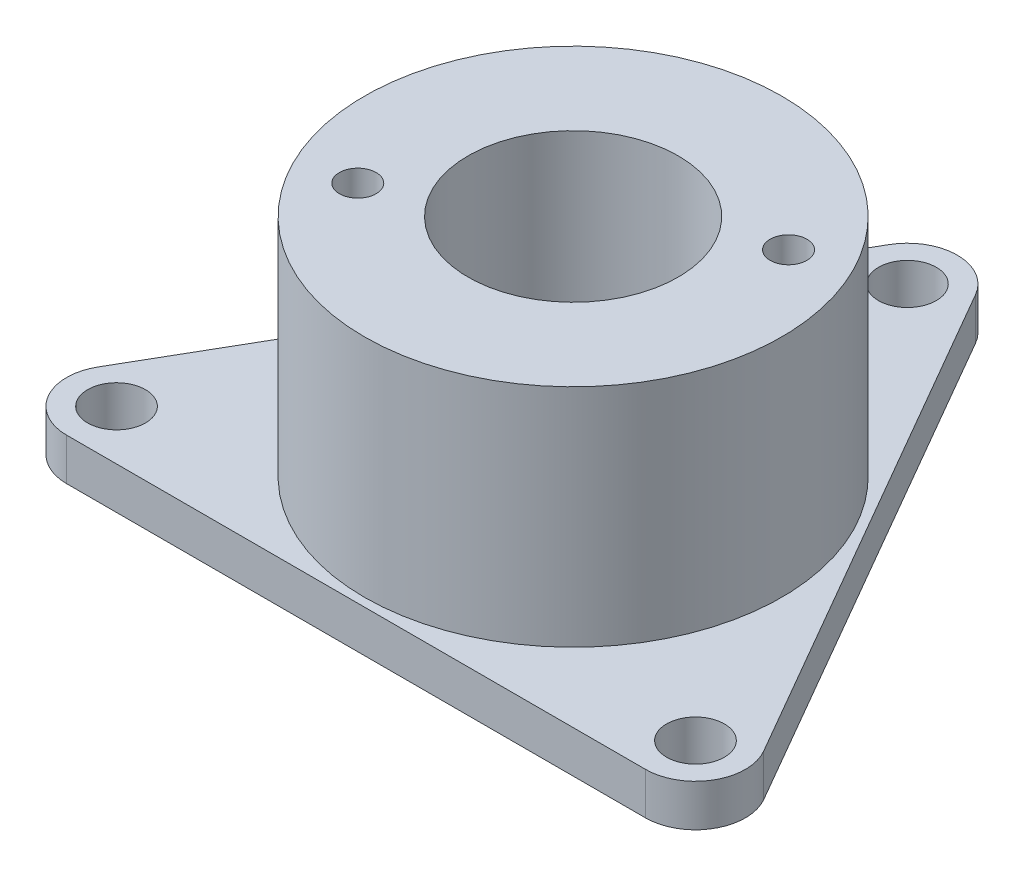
ISO-10303-21;
HEADER;
FILE_DESCRIPTION(('STEP AP214'),'2;1');
FILE_NAME('part.step','',(''),(''),'','','');
FILE_SCHEMA(('AUTOMOTIVE_DESIGN { 1 0 10303 214 1 1 1 1 }'));
ENDSEC;
DATA;
#1=APPLICATION_CONTEXT('core data for automotive mechanical design processes');
#2=APPLICATION_PROTOCOL_DEFINITION('international standard','automotive_design',2000,#1);
#3=PRODUCT_CONTEXT('',#1,'mechanical');
#4=PRODUCT('Part','Part','',(#3));
#5=PRODUCT_RELATED_PRODUCT_CATEGORY('part','',(#4));
#6=PRODUCT_DEFINITION_FORMATION('','',#4);
#7=PRODUCT_DEFINITION_CONTEXT('part definition',#1,'design');
#8=PRODUCT_DEFINITION('design','',#6,#7);
#9=PRODUCT_DEFINITION_SHAPE('','',#8);
#10=(LENGTH_UNIT() NAMED_UNIT(*) SI_UNIT(.MILLI.,.METRE.));
#11=(NAMED_UNIT(*) PLANE_ANGLE_UNIT() SI_UNIT($,.RADIAN.));
#12=(NAMED_UNIT(*) SI_UNIT($,.STERADIAN.) SOLID_ANGLE_UNIT());
#13=UNCERTAINTY_MEASURE_WITH_UNIT(LENGTH_MEASURE(1.E-05),#10,'distance_accuracy_value','');
#14=(GEOMETRIC_REPRESENTATION_CONTEXT(3) GLOBAL_UNCERTAINTY_ASSIGNED_CONTEXT((#13)) GLOBAL_UNIT_ASSIGNED_CONTEXT((#10,
#11,#12)) REPRESENTATION_CONTEXT('',''));
#15=CARTESIAN_POINT('',(0.,0.,0.));
#16=DIRECTION('',(0.,0.,1.));
#17=DIRECTION('',(1.,0.,0.));
#18=AXIS2_PLACEMENT_3D('',#15,#16,#17);
#19=CARTESIAN_POINT('',(0.,3.999992,-31.8008));
#20=DIRECTION('',(0.,1.,0.));
#21=DIRECTION('',(0.,0.,1.));
#22=AXIS2_PLACEMENT_3D('',#19,#20,#21);
#23=PLANE('',#22);
#24=CARTESIAN_POINT('',(0.,3.999992,0.));
#25=DIRECTION('',(0.,1.,0.));
#26=DIRECTION('',(0.,0.,1.));
#27=AXIS2_PLACEMENT_3D('',#24,#25,#26);
#28=CIRCLE('',#27,19.8475);
#29=CARTESIAN_POINT('',(0.,3.999992,-19.8475));
#30=VERTEX_POINT('',#29);
#31=EDGE_CURVE('E147',#30,#30,#28,.T.);
#32=ORIENTED_EDGE('',*,*,#31,.F.);
#33=EDGE_LOOP('',(#32));
#34=FACE_BOUND('',#33,.T.);
#35=CARTESIAN_POINT('',(27.5403006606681,3.999992,15.9004000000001));
#36=DIRECTION('',(0.,1.,0.));
#37=DIRECTION('',(0.,0.,1.));
#38=AXIS2_PLACEMENT_3D('',#35,#36,#37);
#39=CIRCLE('',#38,2.75);
#40=CARTESIAN_POINT('',(27.5403006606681,3.999992,18.6504000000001));
#41=VERTEX_POINT('',#40);
#42=EDGE_CURVE('E166',#41,#41,#39,.T.);
#43=ORIENTED_EDGE('',*,*,#42,.F.);
#44=EDGE_LOOP('',(#43));
#45=FACE_BOUND('',#44,.T.);
#46=CARTESIAN_POINT('',(0.,3.999992,-31.8008));
#47=DIRECTION('',(0.,1.,0.));
#48=DIRECTION('',(0.,0.,1.));
#49=AXIS2_PLACEMENT_3D('',#46,#47,#48);
#50=CIRCLE('',#49,4.75);
#51=CARTESIAN_POINT('',(4.11362066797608,3.999992,-34.1758));
#52=VERTEX_POINT('',#51);
#53=CARTESIAN_POINT('',(-4.11362066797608,3.999992,-34.1758));
#54=VERTEX_POINT('',#53);
#55=EDGE_CURVE('E139',#52,#54,#50,.T.);
#56=ORIENTED_EDGE('',*,*,#55,.T.);
#57=DIRECTION('',(-0.500000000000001,0.,0.866025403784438));
#58=VECTOR('',#57,1.);
#59=CARTESIAN_POINT('',(-4.11362066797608,3.999992,-34.1758));
#60=LINE('',#59,#58);
#61=CARTESIAN_POINT('',(-31.6539213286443,3.999992,13.5253999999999));
#62=VERTEX_POINT('',#61);
#63=EDGE_CURVE('E97',#54,#62,#60,.T.);
#64=ORIENTED_EDGE('',*,*,#63,.T.);
#65=CARTESIAN_POINT('',(-27.5403006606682,3.999992,15.9003999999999));
#66=DIRECTION('',(0.,1.,0.));
#67=DIRECTION('',(0.,0.,1.));
#68=AXIS2_PLACEMENT_3D('',#65,#66,#67);
#69=CIRCLE('',#68,4.75000000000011);
#70=CARTESIAN_POINT('',(-27.5403006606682,3.999992,20.6504));
#71=VERTEX_POINT('',#70);
#72=EDGE_CURVE('E110',#62,#71,#69,.T.);
#73=ORIENTED_EDGE('',*,*,#72,.T.);
#74=DIRECTION('',(1.,0.,0.));
#75=VECTOR('',#74,1.);
#76=CARTESIAN_POINT('',(-27.5403006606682,3.999992,20.6504000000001));
#77=LINE('',#76,#75);
#78=CARTESIAN_POINT('',(27.5403006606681,3.999992,20.6504000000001));
#79=VERTEX_POINT('',#78);
#80=EDGE_CURVE('E104',#71,#79,#77,.T.);
#81=ORIENTED_EDGE('',*,*,#80,.T.);
#82=CARTESIAN_POINT('',(27.5403006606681,3.999992,15.9004000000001));
#83=DIRECTION('',(0.,1.,0.));
#84=DIRECTION('',(0.,0.,1.));
#85=AXIS2_PLACEMENT_3D('',#82,#83,#84);
#86=CIRCLE('',#85,4.75);
#87=CARTESIAN_POINT('',(31.6539213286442,3.999992,13.5254000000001));
#88=VERTEX_POINT('',#87);
#89=EDGE_CURVE('E108',#79,#88,#86,.T.);
#90=ORIENTED_EDGE('',*,*,#89,.T.);
#91=DIRECTION('',(-0.499999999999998,0.,-0.86602540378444));
#92=VECTOR('',#91,1.);
#93=CARTESIAN_POINT('',(31.6539213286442,3.999992,13.5254000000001));
#94=LINE('',#93,#92);
#95=EDGE_CURVE('E59',#88,#52,#94,.T.);
#96=ORIENTED_EDGE('',*,*,#95,.T.);
#97=EDGE_LOOP('',(#56,#64,#73,#81,#90,#96));
#98=FACE_BOUND('',#97,.T.);
#99=CARTESIAN_POINT('',(0.,3.999992,-31.8008));
#100=DIRECTION('',(0.,1.,0.));
#101=DIRECTION('',(0.,0.,1.));
#102=AXIS2_PLACEMENT_3D('',#99,#100,#101);
#103=CIRCLE('',#102,2.75);
#104=CARTESIAN_POINT('',(0.,3.999992,-29.0508));
#105=VERTEX_POINT('',#104);
#106=EDGE_CURVE('E172',#105,#105,#103,.T.);
#107=ORIENTED_EDGE('',*,*,#106,.F.);
#108=EDGE_LOOP('',(#107));
#109=FACE_BOUND('',#108,.T.);
#110=CARTESIAN_POINT('',(-27.5403006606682,3.999992,15.9003999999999));
#111=DIRECTION('',(0.,1.,0.));
#112=DIRECTION('',(0.,0.,1.));
#113=AXIS2_PLACEMENT_3D('',#110,#111,#112);
#114=CIRCLE('',#113,2.75);
#115=CARTESIAN_POINT('',(-27.5403006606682,3.999992,18.6503999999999));
#116=VERTEX_POINT('',#115);
#117=EDGE_CURVE('E159',#116,#116,#114,.T.);
#118=ORIENTED_EDGE('',*,*,#117,.F.);
#119=EDGE_LOOP('',(#118));
#120=FACE_BOUND('',#119,.T.);
#121=ADVANCED_FACE('F41',(#34,#45,#98,#109,#120),#23,.T.);
#122=CARTESIAN_POINT('',(0.,0.,-31.8008));
#123=DIRECTION('',(0.,1.,0.));
#124=DIRECTION('',(0.,0.,1.));
#125=AXIS2_PLACEMENT_3D('',#122,#123,#124);
#126=PLANE('',#125);
#127=CARTESIAN_POINT('',(0.,0.,-31.8008));
#128=DIRECTION('',(0.,1.,0.));
#129=DIRECTION('',(0.,0.,1.));
#130=AXIS2_PLACEMENT_3D('',#127,#128,#129);
#131=CIRCLE('',#130,4.75);
#132=CARTESIAN_POINT('',(4.11362066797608,0.,-34.1758));
#133=VERTEX_POINT('',#132);
#134=CARTESIAN_POINT('',(-4.11362066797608,0.,-34.1758));
#135=VERTEX_POINT('',#134);
#136=EDGE_CURVE('E128',#133,#135,#131,.T.);
#137=ORIENTED_EDGE('',*,*,#136,.F.);
#138=DIRECTION('',(-0.499999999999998,0.,-0.86602540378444));
#139=VECTOR('',#138,1.);
#140=CARTESIAN_POINT('',(31.6539213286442,0.,13.5254000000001));
#141=LINE('',#140,#139);
#142=CARTESIAN_POINT('',(31.6539213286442,0.,13.5254000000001));
#143=VERTEX_POINT('',#142);
#144=EDGE_CURVE('E88',#143,#133,#141,.T.);
#145=ORIENTED_EDGE('',*,*,#144,.F.);
#146=CARTESIAN_POINT('',(27.5403006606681,0.,15.9004000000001));
#147=DIRECTION('',(0.,1.,0.));
#148=DIRECTION('',(0.,0.,1.));
#149=AXIS2_PLACEMENT_3D('',#146,#147,#148);
#150=CIRCLE('',#149,4.75);
#151=CARTESIAN_POINT('',(27.5403006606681,0.,20.6504000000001));
#152=VERTEX_POINT('',#151);
#153=EDGE_CURVE('E82',#152,#143,#150,.T.);
#154=ORIENTED_EDGE('',*,*,#153,.F.);
#155=DIRECTION('',(1.,0.,0.));
#156=VECTOR('',#155,1.);
#157=CARTESIAN_POINT('',(-27.5403006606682,0.,20.6504000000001));
#158=LINE('',#157,#156);
#159=CARTESIAN_POINT('',(-27.5403006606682,0.,20.6504));
#160=VERTEX_POINT('',#159);
#161=EDGE_CURVE('E118',#160,#152,#158,.T.);
#162=ORIENTED_EDGE('',*,*,#161,.F.);
#163=CARTESIAN_POINT('',(-27.5403006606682,0.,15.9003999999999));
#164=DIRECTION('',(0.,1.,0.));
#165=DIRECTION('',(0.,0.,1.));
#166=AXIS2_PLACEMENT_3D('',#163,#164,#165);
#167=CIRCLE('',#166,4.75000000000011);
#168=CARTESIAN_POINT('',(-31.6539213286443,0.,13.5253999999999));
#169=VERTEX_POINT('',#168);
#170=EDGE_CURVE('E134',#169,#160,#167,.T.);
#171=ORIENTED_EDGE('',*,*,#170,.F.);
#172=DIRECTION('',(-0.500000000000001,0.,0.866025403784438));
#173=VECTOR('',#172,1.);
#174=CARTESIAN_POINT('',(-4.11362066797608,0.,-34.1758));
#175=LINE('',#174,#173);
#176=EDGE_CURVE('E131',#135,#169,#175,.T.);
#177=ORIENTED_EDGE('',*,*,#176,.F.);
#178=EDGE_LOOP('',(#137,#145,#154,#162,#171,#177));
#179=FACE_BOUND('',#178,.T.);
#180=CARTESIAN_POINT('',(0.,0.,0.));
#181=DIRECTION('',(0.,1.,0.));
#182=DIRECTION('',(0.,0.,1.));
#183=AXIS2_PLACEMENT_3D('',#180,#181,#182);
#184=CIRCLE('',#183,15.75);
#185=CARTESIAN_POINT('',(0.,0.,15.75));
#186=VERTEX_POINT('',#185);
#187=EDGE_CURVE('E132',#186,#186,#184,.T.);
#188=ORIENTED_EDGE('',*,*,#187,.T.);
#189=EDGE_LOOP('',(#188));
#190=FACE_BOUND('',#189,.T.);
#191=CARTESIAN_POINT('',(0.,0.,-31.8008));
#192=DIRECTION('',(0.,1.,0.));
#193=DIRECTION('',(0.,0.,1.));
#194=AXIS2_PLACEMENT_3D('',#191,#192,#193);
#195=CIRCLE('',#194,2.75);
#196=CARTESIAN_POINT('',(0.,0.,-29.0508));
#197=VERTEX_POINT('',#196);
#198=EDGE_CURVE('E169',#197,#197,#195,.T.);
#199=ORIENTED_EDGE('',*,*,#198,.T.);
#200=EDGE_LOOP('',(#199));
#201=FACE_BOUND('',#200,.T.);
#202=CARTESIAN_POINT('',(27.5403006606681,0.,15.9004000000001));
#203=DIRECTION('',(0.,1.,0.));
#204=DIRECTION('',(0.,0.,1.));
#205=AXIS2_PLACEMENT_3D('',#202,#203,#204);
#206=CIRCLE('',#205,2.75);
#207=CARTESIAN_POINT('',(27.5403006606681,0.,18.6504000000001));
#208=VERTEX_POINT('',#207);
#209=EDGE_CURVE('E162',#208,#208,#206,.T.);
#210=ORIENTED_EDGE('',*,*,#209,.T.);
#211=EDGE_LOOP('',(#210));
#212=FACE_BOUND('',#211,.T.);
#213=CARTESIAN_POINT('',(-27.5403006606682,0.,15.9003999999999));
#214=DIRECTION('',(0.,1.,0.));
#215=DIRECTION('',(0.,0.,1.));
#216=AXIS2_PLACEMENT_3D('',#213,#214,#215);
#217=CIRCLE('',#216,2.75);
#218=CARTESIAN_POINT('',(-27.5403006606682,0.,18.6503999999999));
#219=VERTEX_POINT('',#218);
#220=EDGE_CURVE('E163',#219,#219,#217,.T.);
#221=ORIENTED_EDGE('',*,*,#220,.T.);
#222=EDGE_LOOP('',(#221));
#223=FACE_BOUND('',#222,.T.);
#224=ADVANCED_FACE('F188',(#179,#190,#201,#212,#223),#126,.F.);
#225=CARTESIAN_POINT('',(0.,3.999992,-31.8008));
#226=DIRECTION('',(0.,-1.,0.));
#227=DIRECTION('',(0.,0.,-1.));
#228=AXIS2_PLACEMENT_3D('',#225,#226,#227);
#229=CYLINDRICAL_SURFACE('',#228,4.75);
#230=ORIENTED_EDGE('',*,*,#136,.T.);
#231=DIRECTION('',(0.,-1.,0.));
#232=VECTOR('',#231,1.);
#233=CARTESIAN_POINT('',(-4.11362066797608,3.999992,-34.1758));
#234=LINE('',#233,#232);
#235=EDGE_CURVE('E146',#54,#135,#234,.T.);
#236=ORIENTED_EDGE('',*,*,#235,.F.);
#237=ORIENTED_EDGE('',*,*,#55,.F.);
#238=DIRECTION('',(0.,-1.,0.));
#239=VECTOR('',#238,1.);
#240=CARTESIAN_POINT('',(4.11362066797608,3.999992,-34.1758));
#241=LINE('',#240,#239);
#242=EDGE_CURVE('E124',#52,#133,#241,.T.);
#243=ORIENTED_EDGE('',*,*,#242,.T.);
#244=EDGE_LOOP('',(#230,#236,#237,#243));
#245=FACE_BOUND('',#244,.T.);
#246=ADVANCED_FACE('F191',(#245),#229,.T.);
#247=CARTESIAN_POINT('',(-4.11362066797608,3.999992,-34.1758));
#248=DIRECTION('',(0.866025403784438,0.,0.500000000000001));
#249=DIRECTION('',(0.500000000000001,0.,-0.866025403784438));
#250=AXIS2_PLACEMENT_3D('',#247,#248,#249);
#251=PLANE('',#250);
#252=ORIENTED_EDGE('',*,*,#176,.T.);
#253=DIRECTION('',(0.,-1.,0.));
#254=VECTOR('',#253,1.);
#255=CARTESIAN_POINT('',(-31.6539213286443,3.999992,13.5253999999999));
#256=LINE('',#255,#254);
#257=EDGE_CURVE('E143',#62,#169,#256,.T.);
#258=ORIENTED_EDGE('',*,*,#257,.F.);
#259=ORIENTED_EDGE('',*,*,#63,.F.);
#260=ORIENTED_EDGE('',*,*,#235,.T.);
#261=EDGE_LOOP('',(#252,#258,#259,#260));
#262=FACE_BOUND('',#261,.T.);
#263=ADVANCED_FACE('F182',(#262),#251,.F.);
#264=CARTESIAN_POINT('',(-27.5403006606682,3.999992,15.9003999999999));
#265=DIRECTION('',(0.,-1.,0.));
#266=DIRECTION('',(0.,0.,-1.));
#267=AXIS2_PLACEMENT_3D('',#264,#265,#266);
#268=CYLINDRICAL_SURFACE('',#267,4.75000000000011);
#269=ORIENTED_EDGE('',*,*,#170,.T.);
#270=DIRECTION('',(0.,-1.,0.));
#271=VECTOR('',#270,1.);
#272=CARTESIAN_POINT('',(-27.5403006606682,3.999992,20.6504));
#273=LINE('',#272,#271);
#274=EDGE_CURVE('E119',#71,#160,#273,.T.);
#275=ORIENTED_EDGE('',*,*,#274,.F.);
#276=ORIENTED_EDGE('',*,*,#72,.F.);
#277=ORIENTED_EDGE('',*,*,#257,.T.);
#278=EDGE_LOOP('',(#269,#275,#276,#277));
#279=FACE_BOUND('',#278,.T.);
#280=ADVANCED_FACE('F185',(#279),#268,.T.);
#281=CARTESIAN_POINT('',(-27.5403006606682,3.999992,20.6504000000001));
#282=DIRECTION('',(0.,0.,-1.));
#283=DIRECTION('',(-1.,0.,0.));
#284=AXIS2_PLACEMENT_3D('',#281,#282,#283);
#285=PLANE('',#284);
#286=ORIENTED_EDGE('',*,*,#161,.T.);
#287=DIRECTION('',(0.,-1.,0.));
#288=VECTOR('',#287,1.);
#289=CARTESIAN_POINT('',(27.5403006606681,3.999992,20.6504000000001));
#290=LINE('',#289,#288);
#291=EDGE_CURVE('E115',#79,#152,#290,.T.);
#292=ORIENTED_EDGE('',*,*,#291,.F.);
#293=ORIENTED_EDGE('',*,*,#80,.F.);
#294=ORIENTED_EDGE('',*,*,#274,.T.);
#295=EDGE_LOOP('',(#286,#292,#293,#294));
#296=FACE_BOUND('',#295,.T.);
#297=ADVANCED_FACE('F116',(#296),#285,.F.);
#298=CARTESIAN_POINT('',(27.5403006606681,3.999992,15.9004000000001));
#299=DIRECTION('',(0.,-1.,0.));
#300=DIRECTION('',(0.,0.,-1.));
#301=AXIS2_PLACEMENT_3D('',#298,#299,#300);
#302=CYLINDRICAL_SURFACE('',#301,4.75);
#303=ORIENTED_EDGE('',*,*,#153,.T.);
#304=DIRECTION('',(0.,-1.,0.));
#305=VECTOR('',#304,1.);
#306=CARTESIAN_POINT('',(31.6539213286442,3.999992,13.5254000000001));
#307=LINE('',#306,#305);
#308=EDGE_CURVE('E120',#88,#143,#307,.T.);
#309=ORIENTED_EDGE('',*,*,#308,.F.);
#310=ORIENTED_EDGE('',*,*,#89,.F.);
#311=ORIENTED_EDGE('',*,*,#291,.T.);
#312=EDGE_LOOP('',(#303,#309,#310,#311));
#313=FACE_BOUND('',#312,.T.);
#314=ADVANCED_FACE('F122',(#313),#302,.T.);
#315=CARTESIAN_POINT('',(31.6539213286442,3.999992,13.5254000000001));
#316=DIRECTION('',(-0.86602540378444,0.,0.499999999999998));
#317=DIRECTION('',(0.499999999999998,0.,0.86602540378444));
#318=AXIS2_PLACEMENT_3D('',#315,#316,#317);
#319=PLANE('',#318);
#320=ORIENTED_EDGE('',*,*,#144,.T.);
#321=ORIENTED_EDGE('',*,*,#242,.F.);
#322=ORIENTED_EDGE('',*,*,#95,.F.);
#323=ORIENTED_EDGE('',*,*,#308,.T.);
#324=EDGE_LOOP('',(#320,#321,#322,#323));
#325=FACE_BOUND('',#324,.T.);
#326=ADVANCED_FACE('F192',(#325),#319,.F.);
#327=CARTESIAN_POINT('',(0.,3.999992,0.));
#328=DIRECTION('',(0.,-1.,0.));
#329=DIRECTION('',(0.,0.,-1.));
#330=AXIS2_PLACEMENT_3D('',#327,#328,#329);
#331=CYLINDRICAL_SURFACE('',#330,15.75);
#332=CARTESIAN_POINT('',(0.,2.291568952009,0.));
#333=DIRECTION('',(0.,1.,0.));
#334=DIRECTION('',(0.,0.,1.));
#335=AXIS2_PLACEMENT_3D('',#332,#333,#334);
#336=CIRCLE('',#335,15.75);
#337=CARTESIAN_POINT('',(0.,2.291568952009,15.75));
#338=VERTEX_POINT('',#337);
#339=EDGE_CURVE('E51',#338,#338,#336,.T.);
#340=ORIENTED_EDGE('',*,*,#339,.T.);
#341=EDGE_LOOP('',(#340));
#342=FACE_BOUND('',#341,.T.);
#343=ORIENTED_EDGE('',*,*,#187,.F.);
#344=EDGE_LOOP('',(#343));
#345=FACE_BOUND('',#344,.T.);
#346=ADVANCED_FACE('F194',(#342,#345),#331,.F.);
#347=CARTESIAN_POINT('',(0.,3.999992,-31.8008));
#348=DIRECTION('',(0.,-1.,0.));
#349=DIRECTION('',(0.,0.,-1.));
#350=AXIS2_PLACEMENT_3D('',#347,#348,#349);
#351=CYLINDRICAL_SURFACE('',#350,2.75);
#352=ORIENTED_EDGE('',*,*,#106,.T.);
#353=EDGE_LOOP('',(#352));
#354=FACE_BOUND('',#353,.T.);
#355=ORIENTED_EDGE('',*,*,#198,.F.);
#356=EDGE_LOOP('',(#355));
#357=FACE_BOUND('',#356,.T.);
#358=ADVANCED_FACE('F200',(#354,#357),#351,.F.);
#359=CARTESIAN_POINT('',(27.5403006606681,3.999992,15.9004000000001));
#360=DIRECTION('',(0.,-1.,0.));
#361=DIRECTION('',(0.,0.,-1.));
#362=AXIS2_PLACEMENT_3D('',#359,#360,#361);
#363=CYLINDRICAL_SURFACE('',#362,2.75);
#364=ORIENTED_EDGE('',*,*,#42,.T.);
#365=EDGE_LOOP('',(#364));
#366=FACE_BOUND('',#365,.T.);
#367=ORIENTED_EDGE('',*,*,#209,.F.);
#368=EDGE_LOOP('',(#367));
#369=FACE_BOUND('',#368,.T.);
#370=ADVANCED_FACE('F214',(#366,#369),#363,.F.);
#371=CARTESIAN_POINT('',(-27.5403006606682,3.999992,15.9003999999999));
#372=DIRECTION('',(0.,-1.,0.));
#373=DIRECTION('',(0.,0.,-1.));
#374=AXIS2_PLACEMENT_3D('',#371,#372,#373);
#375=CYLINDRICAL_SURFACE('',#374,2.75);
#376=ORIENTED_EDGE('',*,*,#117,.T.);
#377=EDGE_LOOP('',(#376));
#378=FACE_BOUND('',#377,.T.);
#379=ORIENTED_EDGE('',*,*,#220,.F.);
#380=EDGE_LOOP('',(#379));
#381=FACE_BOUND('',#380,.T.);
#382=ADVANCED_FACE('F218',(#378,#381),#375,.F.);
#383=CARTESIAN_POINT('',(0.,25.459992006,0.));
#384=DIRECTION('',(0.,1.,0.));
#385=DIRECTION('',(0.,0.,1.));
#386=AXIS2_PLACEMENT_3D('',#383,#384,#385);
#387=PLANE('',#386);
#388=CARTESIAN_POINT('',(-12.9903810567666,25.459992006,7.49999999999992));
#389=DIRECTION('',(0.,1.,0.));
#390=DIRECTION('',(0.,0.,1.));
#391=AXIS2_PLACEMENT_3D('',#388,#389,#390);
#392=CIRCLE('',#391,1.75);
#393=CARTESIAN_POINT('',(-12.9903810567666,25.459992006,9.24999999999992));
#394=VERTEX_POINT('',#393);
#395=EDGE_CURVE('E262',#394,#394,#392,.T.);
#396=ORIENTED_EDGE('',*,*,#395,.F.);
#397=EDGE_LOOP('',(#396));
#398=FACE_BOUND('',#397,.T.);
#399=CARTESIAN_POINT('',(12.9903810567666,25.459992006,-7.49999999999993));
#400=DIRECTION('',(0.,1.,0.));
#401=DIRECTION('',(0.,0.,1.));
#402=AXIS2_PLACEMENT_3D('',#399,#400,#401);
#403=CIRCLE('',#402,1.75);
#404=CARTESIAN_POINT('',(12.9903810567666,25.459992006,-5.74999999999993));
#405=VERTEX_POINT('',#404);
#406=EDGE_CURVE('E267',#405,#405,#403,.T.);
#407=ORIENTED_EDGE('',*,*,#406,.F.);
#408=EDGE_LOOP('',(#407));
#409=FACE_BOUND('',#408,.T.);
#410=CARTESIAN_POINT('',(0.,25.459992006,0.));
#411=DIRECTION('',(0.,1.,0.));
#412=DIRECTION('',(0.,0.,1.));
#413=AXIS2_PLACEMENT_3D('',#410,#411,#412);
#414=CIRCLE('',#413,19.8475);
#415=CARTESIAN_POINT('',(0.,25.459992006,-19.8475));
#416=VERTEX_POINT('',#415);
#417=EDGE_CURVE('E157',#416,#416,#414,.T.);
#418=ORIENTED_EDGE('',*,*,#417,.T.);
#419=EDGE_LOOP('',(#418));
#420=FACE_BOUND('',#419,.T.);
#421=CARTESIAN_POINT('',(0.,25.459992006,0.));
#422=DIRECTION('',(0.,1.,0.));
#423=DIRECTION('',(0.,0.,1.));
#424=AXIS2_PLACEMENT_3D('',#421,#422,#423);
#425=CIRCLE('',#424,10.);
#426=CARTESIAN_POINT('',(0.,25.459992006,-10.));
#427=VERTEX_POINT('',#426);
#428=EDGE_CURVE('E265',#427,#427,#425,.T.);
#429=ORIENTED_EDGE('',*,*,#428,.F.);
#430=EDGE_LOOP('',(#429));
#431=FACE_BOUND('',#430,.T.);
#432=ADVANCED_FACE('F222',(#398,#409,#420,#431),#387,.T.);
#433=CARTESIAN_POINT('',(0.,3.999992,0.));
#434=DIRECTION('',(0.,1.,0.));
#435=DIRECTION('',(0.,0.,1.));
#436=AXIS2_PLACEMENT_3D('',#433,#434,#435);
#437=PLANE('',#436);
#438=CARTESIAN_POINT('',(0.,3.999992,0.));
#439=DIRECTION('',(0.,1.,0.));
#440=DIRECTION('',(0.,0.,1.));
#441=AXIS2_PLACEMENT_3D('',#438,#439,#440);
#442=CIRCLE('',#441,10.1620000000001);
#443=CARTESIAN_POINT('',(0.,3.999992,10.1620000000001));
#444=VERTEX_POINT('',#443);
#445=EDGE_CURVE('E11',#444,#444,#442,.F.);
#446=ORIENTED_EDGE('',*,*,#445,.T.);
#447=EDGE_LOOP('',(#446));
#448=FACE_BOUND('',#447,.T.);
#449=CARTESIAN_POINT('',(0.,3.999992,0.));
#450=DIRECTION('',(0.,1.,0.));
#451=DIRECTION('',(0.,0.,1.));
#452=AXIS2_PLACEMENT_3D('',#449,#450,#451);
#453=CIRCLE('',#452,10.);
#454=CARTESIAN_POINT('',(0.,3.999992,-10.));
#455=VERTEX_POINT('',#454);
#456=EDGE_CURVE('E261',#455,#455,#453,.T.);
#457=ORIENTED_EDGE('',*,*,#456,.T.);
#458=EDGE_LOOP('',(#457));
#459=FACE_BOUND('',#458,.T.);
#460=ADVANCED_FACE('F228',(#448,#459),#437,.F.);
#461=CARTESIAN_POINT('',(0.,25.459992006,0.));
#462=DIRECTION('',(0.,-1.,0.));
#463=DIRECTION('',(0.,0.,-1.));
#464=AXIS2_PLACEMENT_3D('',#461,#462,#463);
#465=CYLINDRICAL_SURFACE('',#464,19.8475);
#466=CARTESIAN_POINT('',(0.,25.459992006,-19.8475));
#467=CARTESIAN_POINT('',(0.,25.2364503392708,-19.8475));
#468=CARTESIAN_POINT('',(0.,25.0129086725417,-19.8475));
#469=CARTESIAN_POINT('',(0.,24.5658253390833,-19.8475));
#470=CARTESIAN_POINT('',(0.,24.3422836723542,-19.8475));
#471=CARTESIAN_POINT('',(0.,23.8952003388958,-19.8475));
#472=CARTESIAN_POINT('',(0.,23.6716586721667,-19.8475));
#473=CARTESIAN_POINT('',(0.,23.2245753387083,-19.8475));
#474=CARTESIAN_POINT('',(0.,23.0010336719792,-19.8475));
#475=CARTESIAN_POINT('',(0.,22.5539503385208,-19.8475));
#476=CARTESIAN_POINT('',(0.,22.3304086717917,-19.8475));
#477=CARTESIAN_POINT('',(0.,21.8833253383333,-19.8475));
#478=CARTESIAN_POINT('',(0.,21.6597836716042,-19.8475));
#479=CARTESIAN_POINT('',(0.,21.2127003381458,-19.8475));
#480=CARTESIAN_POINT('',(0.,20.9891586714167,-19.8475));
#481=CARTESIAN_POINT('',(0.,20.5420753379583,-19.8475));
#482=CARTESIAN_POINT('',(0.,20.3185336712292,-19.8475));
#483=CARTESIAN_POINT('',(0.,19.8714503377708,-19.8475));
#484=CARTESIAN_POINT('',(0.,19.6479086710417,-19.8475));
#485=CARTESIAN_POINT('',(0.,19.2008253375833,-19.8475));
#486=CARTESIAN_POINT('',(0.,18.9772836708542,-19.8475));
#487=CARTESIAN_POINT('',(0.,18.5302003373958,-19.8475));
#488=CARTESIAN_POINT('',(0.,18.3066586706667,-19.8475));
#489=CARTESIAN_POINT('',(0.,17.8595753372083,-19.8475));
#490=CARTESIAN_POINT('',(0.,17.6360336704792,-19.8475));
#491=CARTESIAN_POINT('',(0.,17.1889503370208,-19.8475));
#492=CARTESIAN_POINT('',(0.,16.9654086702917,-19.8475));
#493=CARTESIAN_POINT('',(0.,16.5183253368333,-19.8475));
#494=CARTESIAN_POINT('',(0.,16.2947836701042,-19.8475));
#495=CARTESIAN_POINT('',(0.,15.8477003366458,-19.8475));
#496=CARTESIAN_POINT('',(0.,15.6241586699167,-19.8475));
#497=CARTESIAN_POINT('',(0.,15.1770753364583,-19.8475));
#498=CARTESIAN_POINT('',(0.,14.9535336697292,-19.8475));
#499=CARTESIAN_POINT('',(0.,14.5064503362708,-19.8475));
#500=CARTESIAN_POINT('',(0.,14.2829086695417,-19.8475));
#501=CARTESIAN_POINT('',(0.,13.8358253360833,-19.8475));
#502=CARTESIAN_POINT('',(0.,13.6122836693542,-19.8475));
#503=CARTESIAN_POINT('',(0.,13.1652003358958,-19.8475));
#504=CARTESIAN_POINT('',(0.,12.9416586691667,-19.8475));
#505=CARTESIAN_POINT('',(0.,12.4945753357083,-19.8475));
#506=CARTESIAN_POINT('',(0.,12.2710336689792,-19.8475));
#507=CARTESIAN_POINT('',(0.,11.8239503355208,-19.8475));
#508=CARTESIAN_POINT('',(0.,11.6004086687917,-19.8475));
#509=CARTESIAN_POINT('',(0.,11.1533253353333,-19.8475));
#510=CARTESIAN_POINT('',(0.,10.9297836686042,-19.8475));
#511=CARTESIAN_POINT('',(0.,10.4827003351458,-19.8475));
#512=CARTESIAN_POINT('',(0.,10.2591586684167,-19.8475));
#513=CARTESIAN_POINT('',(0.,9.81207533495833,-19.8475));
#514=CARTESIAN_POINT('',(0.,9.58853366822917,-19.8475));
#515=CARTESIAN_POINT('',(0.,9.14145033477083,-19.8475));
#516=CARTESIAN_POINT('',(0.,8.91790866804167,-19.8475));
#517=CARTESIAN_POINT('',(0.,8.47082533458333,-19.8475));
#518=CARTESIAN_POINT('',(0.,8.24728366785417,-19.8475));
#519=CARTESIAN_POINT('',(0.,7.80020033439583,-19.8475));
#520=CARTESIAN_POINT('',(0.,7.57665866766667,-19.8475));
#521=CARTESIAN_POINT('',(0.,7.12957533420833,-19.8475));
#522=CARTESIAN_POINT('',(0.,6.90603366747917,-19.8475));
#523=CARTESIAN_POINT('',(0.,6.45895033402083,-19.8475));
#524=CARTESIAN_POINT('',(0.,6.23540866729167,-19.8475));
#525=CARTESIAN_POINT('',(0.,5.78832533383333,-19.8475));
#526=CARTESIAN_POINT('',(0.,5.56478366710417,-19.8475));
#527=CARTESIAN_POINT('',(0.,5.11770033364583,-19.8475));
#528=CARTESIAN_POINT('',(0.,4.89415866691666,-19.8475));
#529=CARTESIAN_POINT('',(0.,4.44707533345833,-19.8475));
#530=CARTESIAN_POINT('',(0.,4.22353366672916,-19.8475));
#531=CARTESIAN_POINT('',(0.,3.999992,-19.8475));
#532=B_SPLINE_CURVE_WITH_KNOTS('',3,(#466,#467,#468,#469,#470,#471,#472,#473,#474,#475,#476,
#477,#478,#479,#480,#481,#482,#483,#484,#485,#486,#487,#488,#489,#490,#491,#492,#493,#494,#495,
#496,#497,#498,#499,#500,#501,#502,#503,#504,#505,#506,#507,#508,#509,#510,#511,#512,#513,#514,
#515,#516,#517,#518,#519,#520,#521,#522,#523,#524,#525,#526,#527,#528,#529,#530,#531),
.UNSPECIFIED.,.F.,.F.,(4,2,2,2,2,2,2,2,2,2,2,2,2,2,2,2,2,2,2,2,2,2,2,2,2,2,2,2,2,2,2,2,4),(0.,
0.6706250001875,1.341250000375,2.0118750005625,2.68250000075,3.3531250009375,4.023750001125,
4.6943750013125,5.3650000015,6.0356250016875,6.706250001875,7.3768750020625,8.04750000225,
8.7181250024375,9.388750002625,10.0593750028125,10.730000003,11.4006250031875,12.071250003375,
12.7418750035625,13.41250000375,14.0831250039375,14.753750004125,15.4243750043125,16.0950000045,
16.7656250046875,17.436250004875,18.1068750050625,18.77750000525,19.4481250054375,
20.118750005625,20.7893750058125,21.460000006),.UNSPECIFIED.);
#533=EDGE_CURVE('BSEAM224',#416,#30,#532,.T.);
#534=ORIENTED_EDGE('',*,*,#417,.F.);
#535=ORIENTED_EDGE('',*,*,#31,.T.);
#536=ORIENTED_EDGE('',*,*,#533,.T.);
#537=ORIENTED_EDGE('',*,*,#533,.F.);
#538=EDGE_LOOP('',(#534,#536,#535,#537));
#539=FACE_BOUND('',#538,.T.);
#540=ADVANCED_FACE('F224',(#539),#465,.T.);
#541=CARTESIAN_POINT('',(0.,25.459992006,0.));
#542=DIRECTION('',(0.,-1.,0.));
#543=DIRECTION('',(0.,0.,-1.));
#544=AXIS2_PLACEMENT_3D('',#541,#542,#543);
#545=CYLINDRICAL_SURFACE('',#544,10.);
#546=CARTESIAN_POINT('',(0.,25.459992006,-10.));
#547=CARTESIAN_POINT('',(0.,25.2364503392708,-10.));
#548=CARTESIAN_POINT('',(0.,25.0129086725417,-10.));
#549=CARTESIAN_POINT('',(0.,24.5658253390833,-10.));
#550=CARTESIAN_POINT('',(0.,24.3422836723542,-10.));
#551=CARTESIAN_POINT('',(0.,23.8952003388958,-10.));
#552=CARTESIAN_POINT('',(0.,23.6716586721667,-10.));
#553=CARTESIAN_POINT('',(0.,23.2245753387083,-10.));
#554=CARTESIAN_POINT('',(0.,23.0010336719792,-10.));
#555=CARTESIAN_POINT('',(0.,22.5539503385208,-10.));
#556=CARTESIAN_POINT('',(0.,22.3304086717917,-10.));
#557=CARTESIAN_POINT('',(0.,21.8833253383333,-10.));
#558=CARTESIAN_POINT('',(0.,21.6597836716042,-10.));
#559=CARTESIAN_POINT('',(0.,21.2127003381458,-10.));
#560=CARTESIAN_POINT('',(0.,20.9891586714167,-10.));
#561=CARTESIAN_POINT('',(0.,20.5420753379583,-10.));
#562=CARTESIAN_POINT('',(0.,20.3185336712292,-10.));
#563=CARTESIAN_POINT('',(0.,19.8714503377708,-10.));
#564=CARTESIAN_POINT('',(0.,19.6479086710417,-10.));
#565=CARTESIAN_POINT('',(0.,19.2008253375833,-10.));
#566=CARTESIAN_POINT('',(0.,18.9772836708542,-10.));
#567=CARTESIAN_POINT('',(0.,18.5302003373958,-10.));
#568=CARTESIAN_POINT('',(0.,18.3066586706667,-10.));
#569=CARTESIAN_POINT('',(0.,17.8595753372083,-10.));
#570=CARTESIAN_POINT('',(0.,17.6360336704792,-10.));
#571=CARTESIAN_POINT('',(0.,17.1889503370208,-10.));
#572=CARTESIAN_POINT('',(0.,16.9654086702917,-10.));
#573=CARTESIAN_POINT('',(0.,16.5183253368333,-10.));
#574=CARTESIAN_POINT('',(0.,16.2947836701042,-10.));
#575=CARTESIAN_POINT('',(0.,15.8477003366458,-10.));
#576=CARTESIAN_POINT('',(0.,15.6241586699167,-10.));
#577=CARTESIAN_POINT('',(0.,15.1770753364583,-10.));
#578=CARTESIAN_POINT('',(0.,14.9535336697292,-10.));
#579=CARTESIAN_POINT('',(0.,14.5064503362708,-10.));
#580=CARTESIAN_POINT('',(0.,14.2829086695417,-10.));
#581=CARTESIAN_POINT('',(0.,13.8358253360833,-10.));
#582=CARTESIAN_POINT('',(0.,13.6122836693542,-10.));
#583=CARTESIAN_POINT('',(0.,13.1652003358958,-10.));
#584=CARTESIAN_POINT('',(0.,12.9416586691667,-10.));
#585=CARTESIAN_POINT('',(0.,12.4945753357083,-10.));
#586=CARTESIAN_POINT('',(0.,12.2710336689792,-10.));
#587=CARTESIAN_POINT('',(0.,11.8239503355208,-10.));
#588=CARTESIAN_POINT('',(0.,11.6004086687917,-10.));
#589=CARTESIAN_POINT('',(0.,11.1533253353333,-10.));
#590=CARTESIAN_POINT('',(0.,10.9297836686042,-10.));
#591=CARTESIAN_POINT('',(0.,10.4827003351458,-10.));
#592=CARTESIAN_POINT('',(0.,10.2591586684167,-10.));
#593=CARTESIAN_POINT('',(0.,9.81207533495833,-10.));
#594=CARTESIAN_POINT('',(0.,9.58853366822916,-10.));
#595=CARTESIAN_POINT('',(0.,9.14145033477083,-10.));
#596=CARTESIAN_POINT('',(0.,8.91790866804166,-10.));
#597=CARTESIAN_POINT('',(0.,8.47082533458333,-10.));
#598=CARTESIAN_POINT('',(0.,8.24728366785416,-10.));
#599=CARTESIAN_POINT('',(0.,7.80020033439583,-10.));
#600=CARTESIAN_POINT('',(0.,7.57665866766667,-10.));
#601=CARTESIAN_POINT('',(0.,7.12957533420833,-10.));
#602=CARTESIAN_POINT('',(0.,6.90603366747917,-10.));
#603=CARTESIAN_POINT('',(0.,6.45895033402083,-10.));
#604=CARTESIAN_POINT('',(0.,6.23540866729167,-10.));
#605=CARTESIAN_POINT('',(0.,5.78832533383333,-10.));
#606=CARTESIAN_POINT('',(0.,5.56478366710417,-10.));
#607=CARTESIAN_POINT('',(0.,5.11770033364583,-10.));
#608=CARTESIAN_POINT('',(0.,4.89415866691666,-10.));
#609=CARTESIAN_POINT('',(0.,4.44707533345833,-10.));
#610=CARTESIAN_POINT('',(0.,4.22353366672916,-10.));
#611=CARTESIAN_POINT('',(0.,3.999992,-10.));
#612=B_SPLINE_CURVE_WITH_KNOTS('',3,(#546,#547,#548,#549,#550,#551,#552,#553,#554,#555,#556,
#557,#558,#559,#560,#561,#562,#563,#564,#565,#566,#567,#568,#569,#570,#571,#572,#573,#574,#575,
#576,#577,#578,#579,#580,#581,#582,#583,#584,#585,#586,#587,#588,#589,#590,#591,#592,#593,#594,
#595,#596,#597,#598,#599,#600,#601,#602,#603,#604,#605,#606,#607,#608,#609,#610,#611),
.UNSPECIFIED.,.F.,.F.,(4,2,2,2,2,2,2,2,2,2,2,2,2,2,2,2,2,2,2,2,2,2,2,2,2,2,2,2,2,2,2,2,4),(0.,
0.670625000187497,1.341250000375,2.0118750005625,2.68250000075,3.3531250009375,4.023750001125,
4.6943750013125,5.3650000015,6.0356250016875,6.706250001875,7.3768750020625,8.04750000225,
8.7181250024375,9.388750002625,10.0593750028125,10.730000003,11.4006250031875,12.071250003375,
12.7418750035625,13.41250000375,14.0831250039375,14.753750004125,15.4243750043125,16.0950000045,
16.7656250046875,17.436250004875,18.1068750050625,18.77750000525,19.4481250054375,
20.118750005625,20.7893750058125,21.460000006),.UNSPECIFIED.);
#613=EDGE_CURVE('BSEAM227',#427,#455,#612,.T.);
#614=ORIENTED_EDGE('',*,*,#428,.T.);
#615=ORIENTED_EDGE('',*,*,#456,.F.);
#616=ORIENTED_EDGE('',*,*,#613,.T.);
#617=ORIENTED_EDGE('',*,*,#613,.F.);
#618=EDGE_LOOP('',(#614,#616,#615,#617));
#619=FACE_BOUND('',#618,.T.);
#620=ADVANCED_FACE('F227',(#619),#545,.F.);
#621=CARTESIAN_POINT('',(12.9903810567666,4.88599200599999,-7.49999999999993));
#622=DIRECTION('',(0.,1.,0.));
#623=DIRECTION('',(0.,0.,1.));
#624=AXIS2_PLACEMENT_3D('',#621,#622,#623);
#625=CYLINDRICAL_SURFACE('',#624,1.75);
#626=CARTESIAN_POINT('',(12.9903810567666,4.88599200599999,-7.49999999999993));
#627=DIRECTION('',(0.,1.,0.));
#628=DIRECTION('',(0.,0.,1.));
#629=AXIS2_PLACEMENT_3D('',#626,#627,#628);
#630=CIRCLE('',#629,1.75);
#631=CARTESIAN_POINT('',(12.9903810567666,4.88599200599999,-5.74999999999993));
#632=VERTEX_POINT('',#631);
#633=EDGE_CURVE('E272',#632,#632,#630,.T.);
#634=ORIENTED_EDGE('',*,*,#633,.F.);
#635=EDGE_LOOP('',(#634));
#636=FACE_BOUND('',#635,.T.);
#637=ORIENTED_EDGE('',*,*,#406,.T.);
#638=EDGE_LOOP('',(#637));
#639=FACE_BOUND('',#638,.T.);
#640=ADVANCED_FACE('F238',(#636,#639),#625,.F.);
#641=CARTESIAN_POINT('',(12.9903810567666,4.88599200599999,-7.49999999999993));
#642=DIRECTION('',(0.,1.,0.));
#643=DIRECTION('',(0.,0.,1.));
#644=AXIS2_PLACEMENT_3D('',#641,#642,#643);
#645=PLANE('',#644);
#646=ORIENTED_EDGE('',*,*,#633,.T.);
#647=EDGE_LOOP('',(#646));
#648=FACE_BOUND('',#647,.T.);
#649=ADVANCED_FACE('F240',(#648),#645,.T.);
#650=CARTESIAN_POINT('',(-12.9903810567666,4.88599200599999,7.49999999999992));
#651=DIRECTION('',(0.,1.,0.));
#652=DIRECTION('',(0.,0.,1.));
#653=AXIS2_PLACEMENT_3D('',#650,#651,#652);
#654=CYLINDRICAL_SURFACE('',#653,1.75);
#655=CARTESIAN_POINT('',(-12.9903810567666,4.88599200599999,7.49999999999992));
#656=DIRECTION('',(0.,1.,0.));
#657=DIRECTION('',(0.,0.,1.));
#658=AXIS2_PLACEMENT_3D('',#655,#656,#657);
#659=CIRCLE('',#658,1.75);
#660=CARTESIAN_POINT('',(-12.9903810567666,4.88599200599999,9.24999999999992));
#661=VERTEX_POINT('',#660);
#662=EDGE_CURVE('E260',#661,#661,#659,.T.);
#663=ORIENTED_EDGE('',*,*,#662,.F.);
#664=EDGE_LOOP('',(#663));
#665=FACE_BOUND('',#664,.T.);
#666=ORIENTED_EDGE('',*,*,#395,.T.);
#667=EDGE_LOOP('',(#666));
#668=FACE_BOUND('',#667,.T.);
#669=ADVANCED_FACE('F243',(#665,#668),#654,.F.);
#670=CARTESIAN_POINT('',(0.,4.88599200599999,0.));
#671=DIRECTION('',(0.,1.,0.));
#672=DIRECTION('',(0.,0.,1.));
#673=AXIS2_PLACEMENT_3D('',#670,#671,#672);
#674=PLANE('',#673);
#675=ORIENTED_EDGE('',*,*,#662,.T.);
#676=EDGE_LOOP('',(#675));
#677=FACE_BOUND('',#676,.T.);
#678=ADVANCED_FACE('F250',(#677),#674,.T.);
#679=CARTESIAN_POINT('',(0.,2.291568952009,0.));
#680=DIRECTION('',(0.,-1.,0.));
#681=DIRECTION('',(0.,0.,-1.));
#682=AXIS2_PLACEMENT_3D('',#679,#680,#681);
#683=CONICAL_SURFACE('',#682,15.75,1.27409035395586);
#684=ORIENTED_EDGE('',*,*,#445,.F.);
#685=EDGE_LOOP('',(#684));
#686=FACE_BOUND('',#685,.T.);
#687=ORIENTED_EDGE('',*,*,#339,.F.);
#688=EDGE_LOOP('',(#687));
#689=FACE_BOUND('',#688,.T.);
#690=ADVANCED_FACE('F44',(#686,#689),#683,.F.);
#691=CLOSED_SHELL('',(#121,#224,#246,#263,#280,#297,#314,#326,#346,#358,#370,#382,#432,#460,
#540,#620,#640,#649,#669,#678,#690));
#692=MANIFOLD_SOLID_BREP('B2',#691);
#693=ADVANCED_BREP_SHAPE_REPRESENTATION('',(#18,#692),#14);
#694=SHAPE_DEFINITION_REPRESENTATION(#9,#693);
ENDSEC;
END-ISO-10303-21;
